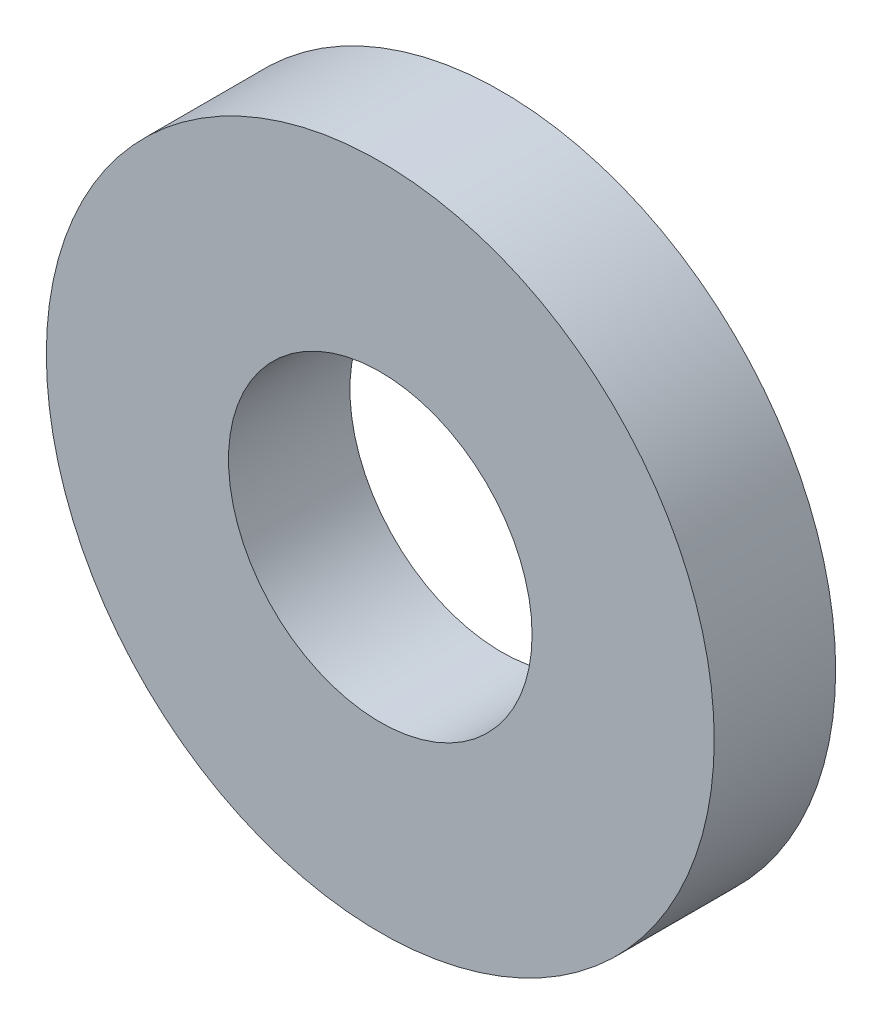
from build123d import *

# Parameters (mm, degrees)
SKETCH1_R           = 11
SKETCH1_R_2         = 5
BOSS_EXTRUDE1_DEPTH = 4


with BuildPart() as part:
    # Sketch1 → Boss-Extrude1 (new body)
    with BuildSketch(Plane.XY):
        with Locations((0.243829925, 0)):
            Circle(SKETCH1_R)
        with Locations((0.243829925, 0)):
            Circle(SKETCH1_R_2, mode=Mode.SUBTRACT)
    extrude(amount=BOSS_EXTRUDE1_DEPTH)


solid = part.part
